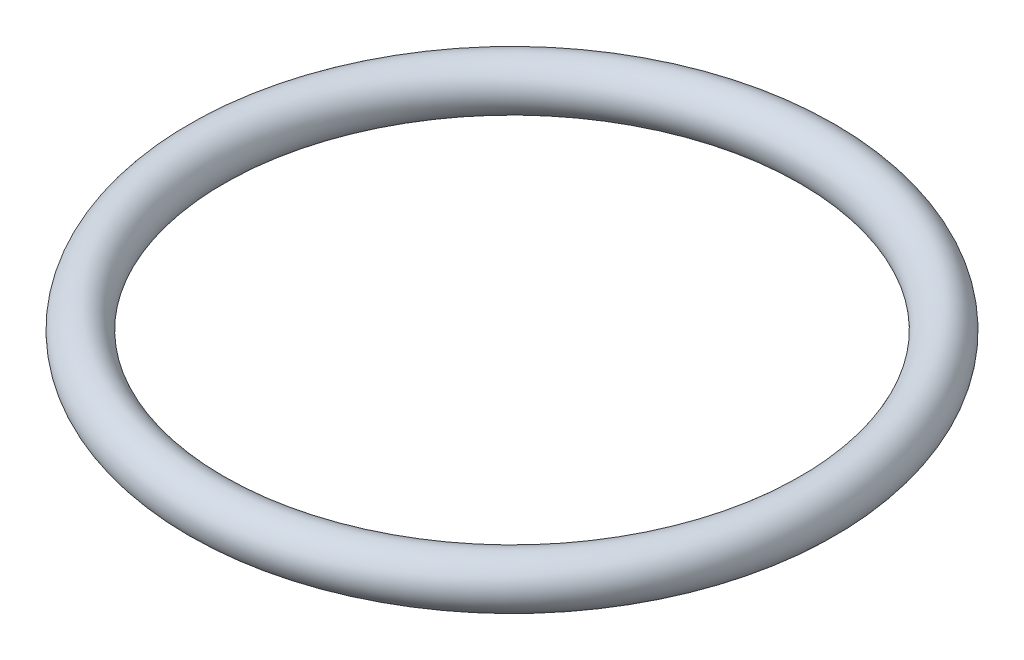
from build123d import *

# Parameters (mm, degrees)
SKETCH1_R = 1.15


with BuildPart() as part:
    # Sketch1 → Revolve1 (revolve)
    with BuildSketch(Plane.XY, mode=Mode.PRIVATE) as revolve1_sk:
        with Locations((-14.45, 0)):
            Circle(SKETCH1_R)
    revolve(revolve1_sk.sketch.rotate(Axis((0, 0, 0), (0, 1, 0)), 270), axis=Axis((0, 0, 0), (0, 1, 0)))


solid = part.part
